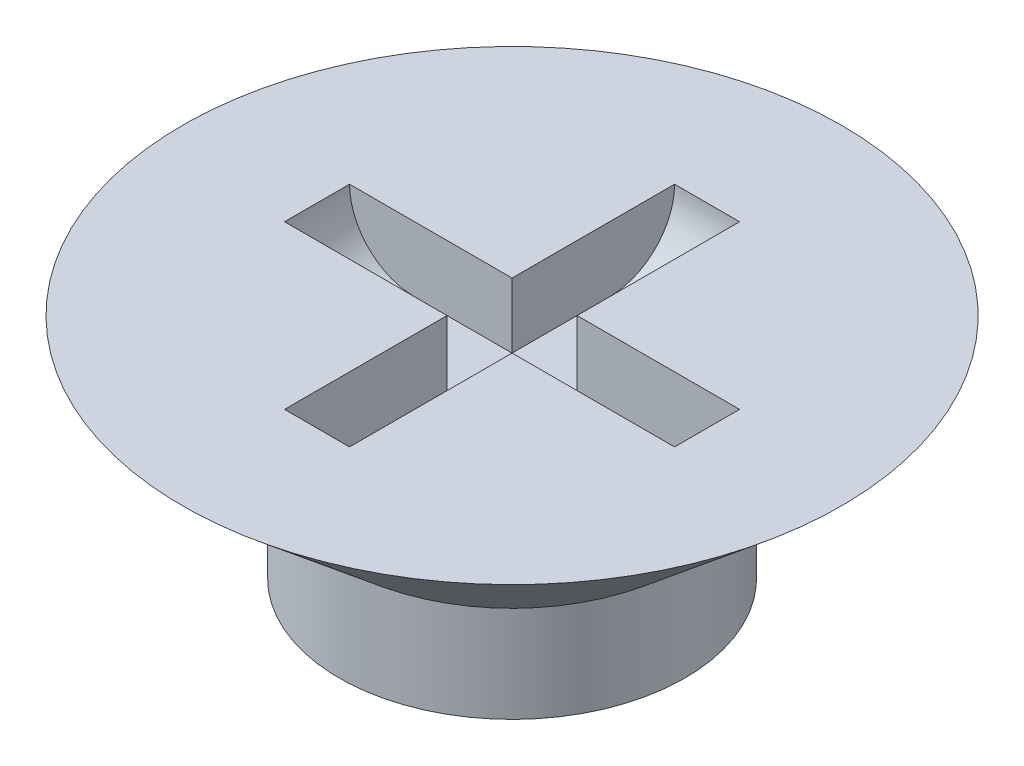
ISO-10303-21;
HEADER;
FILE_DESCRIPTION(('STEP AP214'),'2;1');
FILE_NAME('part.step','',(''),(''),'','','');
FILE_SCHEMA(('AUTOMOTIVE_DESIGN { 1 0 10303 214 1 1 1 1 }'));
ENDSEC;
DATA;
#1=APPLICATION_CONTEXT('core data for automotive mechanical design processes');
#2=APPLICATION_PROTOCOL_DEFINITION('international standard','automotive_design',2000,#1);
#3=PRODUCT_CONTEXT('',#1,'mechanical');
#4=PRODUCT('Part','Part','',(#3));
#5=PRODUCT_RELATED_PRODUCT_CATEGORY('part','',(#4));
#6=PRODUCT_DEFINITION_FORMATION('','',#4);
#7=PRODUCT_DEFINITION_CONTEXT('part definition',#1,'design');
#8=PRODUCT_DEFINITION('design','',#6,#7);
#9=PRODUCT_DEFINITION_SHAPE('','',#8);
#10=(LENGTH_UNIT() NAMED_UNIT(*) SI_UNIT(.MILLI.,.METRE.));
#11=(NAMED_UNIT(*) PLANE_ANGLE_UNIT() SI_UNIT($,.RADIAN.));
#12=(NAMED_UNIT(*) SI_UNIT($,.STERADIAN.) SOLID_ANGLE_UNIT());
#13=UNCERTAINTY_MEASURE_WITH_UNIT(LENGTH_MEASURE(1.E-05),#10,'distance_accuracy_value','');
#14=(GEOMETRIC_REPRESENTATION_CONTEXT(3) GLOBAL_UNCERTAINTY_ASSIGNED_CONTEXT((#13)) GLOBAL_UNIT_ASSIGNED_CONTEXT((#10,
#11,#12)) REPRESENTATION_CONTEXT('',''));
#15=CARTESIAN_POINT('',(0.,0.,0.));
#16=DIRECTION('',(0.,0.,1.));
#17=DIRECTION('',(1.,0.,0.));
#18=AXIS2_PLACEMENT_3D('',#15,#16,#17);
#19=CARTESIAN_POINT('',(0.,0.,-3.3782));
#20=DIRECTION('',(0.,-1.,0.));
#21=DIRECTION('',(0.,0.,-1.));
#22=AXIS2_PLACEMENT_3D('',#19,#20,#21);
#23=PLANE('',#22);
#24=CARTESIAN_POINT('',(0.,0.,0.));
#25=DIRECTION('',(0.,-1.,0.));
#26=DIRECTION('',(0.,0.,-1.));
#27=AXIS2_PLACEMENT_3D('',#24,#25,#26);
#28=CIRCLE('',#27,3.3782);
#29=CARTESIAN_POINT('',(0.,0.,-3.3782));
#30=VERTEX_POINT('',#29);
#31=EDGE_CURVE('E156',#30,#30,#28,.T.);
#32=ORIENTED_EDGE('',*,*,#31,.T.);
#33=EDGE_LOOP('',(#32));
#34=FACE_BOUND('',#33,.T.);
#35=ADVANCED_FACE('F33',(#34),#23,.T.);
#36=CARTESIAN_POINT('',(0.,4.445,0.));
#37=DIRECTION('',(0.,1.,0.));
#38=DIRECTION('',(0.,0.,1.));
#39=AXIS2_PLACEMENT_3D('',#36,#37,#38);
#40=PLANE('',#39);
#41=DIRECTION('',(1.,0.,0.));
#42=VECTOR('',#41,1.);
#43=CARTESIAN_POINT('',(0.,4.445,0.635));
#44=LINE('',#43,#42);
#45=CARTESIAN_POINT('',(-3.81,4.445,0.635));
#46=VERTEX_POINT('',#45);
#47=CARTESIAN_POINT('',(-0.635000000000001,4.445,0.635));
#48=VERTEX_POINT('',#47);
#49=EDGE_CURVE('E146',#46,#48,#44,.T.);
#50=ORIENTED_EDGE('',*,*,#49,.F.);
#51=DIRECTION('',(0.,0.,-1.));
#52=VECTOR('',#51,1.);
#53=CARTESIAN_POINT('',(-3.81,4.445,0.));
#54=LINE('',#53,#52);
#55=CARTESIAN_POINT('',(-3.81,4.445,-0.635));
#56=VERTEX_POINT('',#55);
#57=EDGE_CURVE('E142',#46,#56,#54,.T.);
#58=ORIENTED_EDGE('',*,*,#57,.T.);
#59=DIRECTION('',(1.,0.,0.));
#60=VECTOR('',#59,1.);
#61=CARTESIAN_POINT('',(0.,4.445,-0.635));
#62=LINE('',#61,#60);
#63=CARTESIAN_POINT('',(-0.635000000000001,4.445,-0.635));
#64=VERTEX_POINT('',#63);
#65=EDGE_CURVE('E221',#56,#64,#62,.T.);
#66=ORIENTED_EDGE('',*,*,#65,.T.);
#67=DIRECTION('',(0.,0.,-1.));
#68=VECTOR('',#67,1.);
#69=CARTESIAN_POINT('',(-0.635000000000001,4.445,0.));
#70=LINE('',#69,#68);
#71=CARTESIAN_POINT('',(-0.635000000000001,4.445,-3.81));
#72=VERTEX_POINT('',#71);
#73=EDGE_CURVE('E218',#64,#72,#70,.T.);
#74=ORIENTED_EDGE('',*,*,#73,.T.);
#75=DIRECTION('',(1.,0.,0.));
#76=VECTOR('',#75,1.);
#77=CARTESIAN_POINT('',(0.,4.445,-3.81));
#78=LINE('',#77,#76);
#79=CARTESIAN_POINT('',(0.634999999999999,4.445,-3.81));
#80=VERTEX_POINT('',#79);
#81=EDGE_CURVE('E215',#72,#80,#78,.T.);
#82=ORIENTED_EDGE('',*,*,#81,.T.);
#83=DIRECTION('',(0.,0.,-1.));
#84=VECTOR('',#83,1.);
#85=CARTESIAN_POINT('',(0.634999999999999,4.445,0.));
#86=LINE('',#85,#84);
#87=CARTESIAN_POINT('',(0.634999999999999,4.445,-0.635));
#88=VERTEX_POINT('',#87);
#89=EDGE_CURVE('E213',#88,#80,#86,.T.);
#90=ORIENTED_EDGE('',*,*,#89,.F.);
#91=DIRECTION('',(1.,0.,0.));
#92=VECTOR('',#91,1.);
#93=CARTESIAN_POINT('',(0.,4.445,-0.635));
#94=LINE('',#93,#92);
#95=CARTESIAN_POINT('',(3.81,4.445,-0.635));
#96=VERTEX_POINT('',#95);
#97=EDGE_CURVE('E210',#88,#96,#94,.T.);
#98=ORIENTED_EDGE('',*,*,#97,.T.);
#99=DIRECTION('',(0.,0.,-1.));
#100=VECTOR('',#99,1.);
#101=CARTESIAN_POINT('',(3.81,4.445,0.));
#102=LINE('',#101,#100);
#103=CARTESIAN_POINT('',(3.81,4.445,0.635000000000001));
#104=VERTEX_POINT('',#103);
#105=EDGE_CURVE('E207',#104,#96,#102,.T.);
#106=ORIENTED_EDGE('',*,*,#105,.F.);
#107=DIRECTION('',(1.,0.,0.));
#108=VECTOR('',#107,1.);
#109=CARTESIAN_POINT('',(0.,4.445,0.635));
#110=LINE('',#109,#108);
#111=CARTESIAN_POINT('',(0.634999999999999,4.445,0.635));
#112=VERTEX_POINT('',#111);
#113=EDGE_CURVE('E199',#112,#104,#110,.T.);
#114=ORIENTED_EDGE('',*,*,#113,.F.);
#115=DIRECTION('',(0.,0.,-1.));
#116=VECTOR('',#115,1.);
#117=CARTESIAN_POINT('',(0.634999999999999,4.445,0.));
#118=LINE('',#117,#116);
#119=CARTESIAN_POINT('',(0.634999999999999,4.445,3.81));
#120=VERTEX_POINT('',#119);
#121=EDGE_CURVE('E189',#120,#112,#118,.T.);
#122=ORIENTED_EDGE('',*,*,#121,.F.);
#123=DIRECTION('',(1.,0.,0.));
#124=VECTOR('',#123,1.);
#125=CARTESIAN_POINT('',(0.,4.445,3.81));
#126=LINE('',#125,#124);
#127=CARTESIAN_POINT('',(-0.635000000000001,4.445,3.81));
#128=VERTEX_POINT('',#127);
#129=EDGE_CURVE('E197',#128,#120,#126,.T.);
#130=ORIENTED_EDGE('',*,*,#129,.F.);
#131=DIRECTION('',(0.,0.,-1.));
#132=VECTOR('',#131,1.);
#133=CARTESIAN_POINT('',(-0.635000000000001,4.445,0.));
#134=LINE('',#133,#132);
#135=EDGE_CURVE('E201',#128,#48,#134,.T.);
#136=ORIENTED_EDGE('',*,*,#135,.T.);
#137=EDGE_LOOP('',(#50,#58,#66,#74,#82,#90,#98,#106,#114,#122,#130,#136));
#138=FACE_BOUND('',#137,.T.);
#139=CARTESIAN_POINT('',(0.,4.445,0.));
#140=DIRECTION('',(0.,-1.,0.));
#141=DIRECTION('',(0.,0.,-1.));
#142=AXIS2_PLACEMENT_3D('',#139,#140,#141);
#143=CIRCLE('',#142,6.4389);
#144=CARTESIAN_POINT('',(0.,4.445,-6.4389));
#145=VERTEX_POINT('',#144);
#146=EDGE_CURVE('E163',#145,#145,#143,.T.);
#147=ORIENTED_EDGE('',*,*,#146,.F.);
#148=EDGE_LOOP('',(#147));
#149=FACE_BOUND('',#148,.T.);
#150=ADVANCED_FACE('F195',(#138,#149),#40,.T.);
#151=CARTESIAN_POINT('',(0.,1.8796,0.));
#152=DIRECTION('',(0.,1.,0.));
#153=DIRECTION('',(0.,0.,1.));
#154=AXIS2_PLACEMENT_3D('',#151,#152,#153);
#155=CONICAL_SURFACE('',#154,3.3782,0.873207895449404);
#156=ORIENTED_EDGE('',*,*,#146,.T.);
#157=EDGE_LOOP('',(#156));
#158=FACE_BOUND('',#157,.T.);
#159=CARTESIAN_POINT('',(0.,1.8796,0.));
#160=DIRECTION('',(0.,-1.,0.));
#161=DIRECTION('',(0.,0.,-1.));
#162=AXIS2_PLACEMENT_3D('',#159,#160,#161);
#163=CIRCLE('',#162,3.3782);
#164=CARTESIAN_POINT('',(0.,1.8796,-3.3782));
#165=VERTEX_POINT('',#164);
#166=EDGE_CURVE('E159',#165,#165,#163,.T.);
#167=ORIENTED_EDGE('',*,*,#166,.F.);
#168=EDGE_LOOP('',(#167));
#169=FACE_BOUND('',#168,.T.);
#170=ADVANCED_FACE('F270',(#158,#169),#155,.T.);
#171=CARTESIAN_POINT('',(0.,0.,0.));
#172=DIRECTION('',(0.,-1.,0.));
#173=DIRECTION('',(0.,0.,-1.));
#174=AXIS2_PLACEMENT_3D('',#171,#172,#173);
#175=CYLINDRICAL_SURFACE('',#174,3.3782);
#176=ORIENTED_EDGE('',*,*,#166,.T.);
#177=EDGE_LOOP('',(#176));
#178=FACE_BOUND('',#177,.T.);
#179=ORIENTED_EDGE('',*,*,#31,.F.);
#180=EDGE_LOOP('',(#179));
#181=FACE_BOUND('',#180,.T.);
#182=ADVANCED_FACE('F291',(#178,#181),#175,.T.);
#183=CARTESIAN_POINT('',(0.,3.175,0.635));
#184=DIRECTION('',(0.,0.,1.));
#185=DIRECTION('',(1.,0.,0.));
#186=AXIS2_PLACEMENT_3D('',#183,#184,#185);
#187=PLANE('',#186);
#188=DIRECTION('',(1.,0.,0.));
#189=VECTOR('',#188,1.);
#190=CARTESIAN_POINT('',(0.,3.175,0.635));
#191=LINE('',#190,#189);
#192=CARTESIAN_POINT('',(-2.54,3.175,0.635));
#193=VERTEX_POINT('',#192);
#194=CARTESIAN_POINT('',(-0.635000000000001,3.175,0.635));
#195=VERTEX_POINT('',#194);
#196=EDGE_CURVE('E133',#193,#195,#191,.T.);
#197=ORIENTED_EDGE('',*,*,#196,.F.);
#198=CARTESIAN_POINT('',(-2.54,4.445,0.635));
#199=DIRECTION('',(0.,0.,1.));
#200=DIRECTION('',(1.,0.,0.));
#201=AXIS2_PLACEMENT_3D('',#198,#199,#200);
#202=CIRCLE('',#201,1.27);
#203=EDGE_CURVE('E175',#193,#46,#202,.F.);
#204=ORIENTED_EDGE('',*,*,#203,.T.);
#205=ORIENTED_EDGE('',*,*,#49,.T.);
#206=DIRECTION('',(0.,1.,0.));
#207=VECTOR('',#206,1.);
#208=CARTESIAN_POINT('',(-0.635000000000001,3.175,0.635));
#209=LINE('',#208,#207);
#210=EDGE_CURVE('E127',#195,#48,#209,.T.);
#211=ORIENTED_EDGE('',*,*,#210,.F.);
#212=EDGE_LOOP('',(#197,#204,#205,#211));
#213=FACE_BOUND('',#212,.T.);
#214=ADVANCED_FACE('F144',(#213),#187,.F.);
#215=CARTESIAN_POINT('',(0.,3.175,-0.635));
#216=DIRECTION('',(0.,0.,1.));
#217=DIRECTION('',(1.,0.,0.));
#218=AXIS2_PLACEMENT_3D('',#215,#216,#217);
#219=PLANE('',#218);
#220=ORIENTED_EDGE('',*,*,#65,.F.);
#221=CARTESIAN_POINT('',(-2.54,4.445,-0.635));
#222=DIRECTION('',(0.,0.,1.));
#223=DIRECTION('',(1.,0.,0.));
#224=AXIS2_PLACEMENT_3D('',#221,#222,#223);
#225=CIRCLE('',#224,1.27);
#226=CARTESIAN_POINT('',(-2.54,3.175,-0.635));
#227=VERTEX_POINT('',#226);
#228=EDGE_CURVE('E166',#56,#227,#225,.T.);
#229=ORIENTED_EDGE('',*,*,#228,.T.);
#230=DIRECTION('',(1.,0.,0.));
#231=VECTOR('',#230,1.);
#232=CARTESIAN_POINT('',(0.,3.175,-0.635));
#233=LINE('',#232,#231);
#234=CARTESIAN_POINT('',(-0.635000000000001,3.175,-0.635));
#235=VERTEX_POINT('',#234);
#236=EDGE_CURVE('E148',#227,#235,#233,.T.);
#237=ORIENTED_EDGE('',*,*,#236,.T.);
#238=DIRECTION('',(0.,1.,0.));
#239=VECTOR('',#238,1.);
#240=CARTESIAN_POINT('',(-0.635000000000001,3.175,-0.635));
#241=LINE('',#240,#239);
#242=EDGE_CURVE('E160',#235,#64,#241,.T.);
#243=ORIENTED_EDGE('',*,*,#242,.T.);
#244=EDGE_LOOP('',(#220,#229,#237,#243));
#245=FACE_BOUND('',#244,.T.);
#246=ADVANCED_FACE('F283',(#245),#219,.T.);
#247=CARTESIAN_POINT('',(-0.635000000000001,3.175,0.));
#248=DIRECTION('',(1.,0.,0.));
#249=DIRECTION('',(0.,0.,-1.));
#250=AXIS2_PLACEMENT_3D('',#247,#248,#249);
#251=PLANE('',#250);
#252=DIRECTION('',(0.,0.,-1.));
#253=VECTOR('',#252,1.);
#254=CARTESIAN_POINT('',(-0.635000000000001,3.175,0.));
#255=LINE('',#254,#253);
#256=CARTESIAN_POINT('',(-0.635000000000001,3.175,-2.54));
#257=VERTEX_POINT('',#256);
#258=EDGE_CURVE('E152',#235,#257,#255,.T.);
#259=ORIENTED_EDGE('',*,*,#258,.T.);
#260=CARTESIAN_POINT('',(-0.635000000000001,4.445,-2.54));
#261=DIRECTION('',(1.,0.,0.));
#262=DIRECTION('',(0.,0.,-1.));
#263=AXIS2_PLACEMENT_3D('',#260,#261,#262);
#264=CIRCLE('',#263,1.27);
#265=EDGE_CURVE('E178',#257,#72,#264,.T.);
#266=ORIENTED_EDGE('',*,*,#265,.T.);
#267=ORIENTED_EDGE('',*,*,#73,.F.);
#268=ORIENTED_EDGE('',*,*,#242,.F.);
#269=EDGE_LOOP('',(#259,#266,#267,#268));
#270=FACE_BOUND('',#269,.T.);
#271=ADVANCED_FACE('F240',(#270),#251,.T.);
#272=CARTESIAN_POINT('',(0.634999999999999,3.175,0.));
#273=DIRECTION('',(1.,0.,0.));
#274=DIRECTION('',(0.,0.,-1.));
#275=AXIS2_PLACEMENT_3D('',#272,#273,#274);
#276=PLANE('',#275);
#277=ORIENTED_EDGE('',*,*,#89,.T.);
#278=CARTESIAN_POINT('',(0.634999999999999,4.445,-2.54));
#279=DIRECTION('',(1.,0.,0.));
#280=DIRECTION('',(0.,0.,-1.));
#281=AXIS2_PLACEMENT_3D('',#278,#279,#280);
#282=CIRCLE('',#281,1.27);
#283=CARTESIAN_POINT('',(0.634999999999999,3.175,-2.54));
#284=VERTEX_POINT('',#283);
#285=EDGE_CURVE('E56',#80,#284,#282,.F.);
#286=ORIENTED_EDGE('',*,*,#285,.T.);
#287=DIRECTION('',(0.,0.,-1.));
#288=VECTOR('',#287,1.);
#289=CARTESIAN_POINT('',(0.634999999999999,3.175,0.));
#290=LINE('',#289,#288);
#291=CARTESIAN_POINT('',(0.634999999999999,3.175,-0.635));
#292=VERTEX_POINT('',#291);
#293=EDGE_CURVE('E229',#292,#284,#290,.T.);
#294=ORIENTED_EDGE('',*,*,#293,.F.);
#295=DIRECTION('',(0.,1.,0.));
#296=VECTOR('',#295,1.);
#297=CARTESIAN_POINT('',(0.634999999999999,3.175,-0.635));
#298=LINE('',#297,#296);
#299=EDGE_CURVE('E150',#292,#88,#298,.T.);
#300=ORIENTED_EDGE('',*,*,#299,.T.);
#301=EDGE_LOOP('',(#277,#286,#294,#300));
#302=FACE_BOUND('',#301,.T.);
#303=ADVANCED_FACE('F227',(#302),#276,.F.);
#304=CARTESIAN_POINT('',(0.,3.175,-0.635));
#305=DIRECTION('',(0.,0.,1.));
#306=DIRECTION('',(1.,0.,0.));
#307=AXIS2_PLACEMENT_3D('',#304,#305,#306);
#308=PLANE('',#307);
#309=DIRECTION('',(1.,0.,0.));
#310=VECTOR('',#309,1.);
#311=CARTESIAN_POINT('',(0.,3.175,-0.635));
#312=LINE('',#311,#310);
#313=CARTESIAN_POINT('',(2.54,3.175,-0.635));
#314=VERTEX_POINT('',#313);
#315=EDGE_CURVE('E243',#292,#314,#312,.T.);
#316=ORIENTED_EDGE('',*,*,#315,.T.);
#317=CARTESIAN_POINT('',(2.54,4.445,-0.635));
#318=DIRECTION('',(0.,0.,1.));
#319=DIRECTION('',(1.,0.,0.));
#320=AXIS2_PLACEMENT_3D('',#317,#318,#319);
#321=CIRCLE('',#320,1.27);
#322=EDGE_CURVE('E180',#314,#96,#321,.T.);
#323=ORIENTED_EDGE('',*,*,#322,.T.);
#324=ORIENTED_EDGE('',*,*,#97,.F.);
#325=ORIENTED_EDGE('',*,*,#299,.F.);
#326=EDGE_LOOP('',(#316,#323,#324,#325));
#327=FACE_BOUND('',#326,.T.);
#328=ADVANCED_FACE('F233',(#327),#308,.T.);
#329=CARTESIAN_POINT('',(0.,3.175,0.635));
#330=DIRECTION('',(0.,0.,1.));
#331=DIRECTION('',(1.,0.,0.));
#332=AXIS2_PLACEMENT_3D('',#329,#330,#331);
#333=PLANE('',#332);
#334=ORIENTED_EDGE('',*,*,#113,.T.);
#335=CARTESIAN_POINT('',(2.54,4.445,0.635000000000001));
#336=DIRECTION('',(0.,0.,1.));
#337=DIRECTION('',(1.,0.,0.));
#338=AXIS2_PLACEMENT_3D('',#335,#336,#337);
#339=CIRCLE('',#338,1.27);
#340=CARTESIAN_POINT('',(2.54,3.175,0.635000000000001));
#341=VERTEX_POINT('',#340);
#342=EDGE_CURVE('E182',#104,#341,#339,.F.);
#343=ORIENTED_EDGE('',*,*,#342,.T.);
#344=DIRECTION('',(1.,0.,0.));
#345=VECTOR('',#344,1.);
#346=CARTESIAN_POINT('',(0.,3.175,0.635));
#347=LINE('',#346,#345);
#348=CARTESIAN_POINT('',(0.634999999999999,3.175,0.635));
#349=VERTEX_POINT('',#348);
#350=EDGE_CURVE('E247',#349,#341,#347,.T.);
#351=ORIENTED_EDGE('',*,*,#350,.F.);
#352=DIRECTION('',(0.,1.,0.));
#353=VECTOR('',#352,1.);
#354=CARTESIAN_POINT('',(0.634999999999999,3.175,0.635));
#355=LINE('',#354,#353);
#356=EDGE_CURVE('E147',#349,#112,#355,.T.);
#357=ORIENTED_EDGE('',*,*,#356,.T.);
#358=EDGE_LOOP('',(#334,#343,#351,#357));
#359=FACE_BOUND('',#358,.T.);
#360=ADVANCED_FACE('F253',(#359),#333,.F.);
#361=CARTESIAN_POINT('',(0.634999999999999,3.175,0.));
#362=DIRECTION('',(1.,0.,0.));
#363=DIRECTION('',(0.,0.,-1.));
#364=AXIS2_PLACEMENT_3D('',#361,#362,#363);
#365=PLANE('',#364);
#366=DIRECTION('',(0.,0.,-1.));
#367=VECTOR('',#366,1.);
#368=CARTESIAN_POINT('',(0.634999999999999,3.175,0.));
#369=LINE('',#368,#367);
#370=CARTESIAN_POINT('',(0.634999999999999,3.175,2.54));
#371=VERTEX_POINT('',#370);
#372=EDGE_CURVE('E132',#371,#349,#369,.T.);
#373=ORIENTED_EDGE('',*,*,#372,.F.);
#374=CARTESIAN_POINT('',(0.634999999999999,4.445,2.54));
#375=DIRECTION('',(1.,0.,0.));
#376=DIRECTION('',(0.,0.,-1.));
#377=AXIS2_PLACEMENT_3D('',#374,#375,#376);
#378=CIRCLE('',#377,1.27);
#379=EDGE_CURVE('E41',#371,#120,#378,.F.);
#380=ORIENTED_EDGE('',*,*,#379,.T.);
#381=ORIENTED_EDGE('',*,*,#121,.T.);
#382=ORIENTED_EDGE('',*,*,#356,.F.);
#383=EDGE_LOOP('',(#373,#380,#381,#382));
#384=FACE_BOUND('',#383,.T.);
#385=ADVANCED_FACE('F187',(#384),#365,.F.);
#386=CARTESIAN_POINT('',(-0.635000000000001,3.175,0.));
#387=DIRECTION('',(1.,0.,0.));
#388=DIRECTION('',(0.,0.,-1.));
#389=AXIS2_PLACEMENT_3D('',#386,#387,#388);
#390=PLANE('',#389);
#391=ORIENTED_EDGE('',*,*,#135,.F.);
#392=CARTESIAN_POINT('',(-0.635000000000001,4.445,2.54));
#393=DIRECTION('',(1.,0.,0.));
#394=DIRECTION('',(0.,0.,-1.));
#395=AXIS2_PLACEMENT_3D('',#392,#393,#394);
#396=CIRCLE('',#395,1.27);
#397=CARTESIAN_POINT('',(-0.635000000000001,3.175,2.54));
#398=VERTEX_POINT('',#397);
#399=EDGE_CURVE('E11',#128,#398,#396,.T.);
#400=ORIENTED_EDGE('',*,*,#399,.T.);
#401=DIRECTION('',(0.,0.,-1.));
#402=VECTOR('',#401,1.);
#403=CARTESIAN_POINT('',(-0.635000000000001,3.175,0.));
#404=LINE('',#403,#402);
#405=EDGE_CURVE('E123',#398,#195,#404,.T.);
#406=ORIENTED_EDGE('',*,*,#405,.T.);
#407=ORIENTED_EDGE('',*,*,#210,.T.);
#408=EDGE_LOOP('',(#391,#400,#406,#407));
#409=FACE_BOUND('',#408,.T.);
#410=ADVANCED_FACE('F125',(#409),#390,.T.);
#411=CARTESIAN_POINT('',(0.,3.175,0.));
#412=DIRECTION('',(0.,1.,0.));
#413=DIRECTION('',(0.,0.,1.));
#414=AXIS2_PLACEMENT_3D('',#411,#412,#413);
#415=PLANE('',#414);
#416=ORIENTED_EDGE('',*,*,#236,.F.);
#417=DIRECTION('',(0.,0.,-1.));
#418=VECTOR('',#417,1.);
#419=CARTESIAN_POINT('',(-2.54,3.175,0.635));
#420=LINE('',#419,#418);
#421=EDGE_CURVE('E139',#227,#193,#420,.F.);
#422=ORIENTED_EDGE('',*,*,#421,.T.);
#423=ORIENTED_EDGE('',*,*,#196,.T.);
#424=ORIENTED_EDGE('',*,*,#405,.F.);
#425=DIRECTION('',(1.,0.,0.));
#426=VECTOR('',#425,1.);
#427=CARTESIAN_POINT('',(0.,3.175,2.54));
#428=LINE('',#427,#426);
#429=EDGE_CURVE('E168',#398,#371,#428,.T.);
#430=ORIENTED_EDGE('',*,*,#429,.T.);
#431=ORIENTED_EDGE('',*,*,#372,.T.);
#432=ORIENTED_EDGE('',*,*,#350,.T.);
#433=DIRECTION('',(0.,0.,-1.));
#434=VECTOR('',#433,1.);
#435=CARTESIAN_POINT('',(2.54,3.175,0.));
#436=LINE('',#435,#434);
#437=EDGE_CURVE('E170',#341,#314,#436,.T.);
#438=ORIENTED_EDGE('',*,*,#437,.T.);
#439=ORIENTED_EDGE('',*,*,#315,.F.);
#440=ORIENTED_EDGE('',*,*,#293,.T.);
#441=DIRECTION('',(1.,0.,0.));
#442=VECTOR('',#441,1.);
#443=CARTESIAN_POINT('',(-0.635,3.175,-2.54));
#444=LINE('',#443,#442);
#445=EDGE_CURVE('E48',#284,#257,#444,.F.);
#446=ORIENTED_EDGE('',*,*,#445,.T.);
#447=ORIENTED_EDGE('',*,*,#258,.F.);
#448=EDGE_LOOP('',(#416,#422,#423,#424,#430,#431,#432,#438,#439,#440,#446,#447));
#449=FACE_BOUND('',#448,.T.);
#450=ADVANCED_FACE('F137',(#449),#415,.T.);
#451=CARTESIAN_POINT('',(-2.54,4.445,0.));
#452=DIRECTION('',(0.,0.,1.));
#453=DIRECTION('',(1.,0.,0.));
#454=AXIS2_PLACEMENT_3D('',#451,#452,#453);
#455=CYLINDRICAL_SURFACE('',#454,1.27);
#456=ORIENTED_EDGE('',*,*,#203,.F.);
#457=ORIENTED_EDGE('',*,*,#421,.F.);
#458=ORIENTED_EDGE('',*,*,#228,.F.);
#459=ORIENTED_EDGE('',*,*,#57,.F.);
#460=EDGE_LOOP('',(#456,#457,#458,#459));
#461=FACE_BOUND('',#460,.T.);
#462=ADVANCED_FACE('F262',(#461),#455,.F.);
#463=CARTESIAN_POINT('',(0.,4.445,-2.54));
#464=DIRECTION('',(-1.,0.,0.));
#465=DIRECTION('',(0.,0.,1.));
#466=AXIS2_PLACEMENT_3D('',#463,#464,#465);
#467=CYLINDRICAL_SURFACE('',#466,1.27);
#468=ORIENTED_EDGE('',*,*,#265,.F.);
#469=ORIENTED_EDGE('',*,*,#445,.F.);
#470=ORIENTED_EDGE('',*,*,#285,.F.);
#471=ORIENTED_EDGE('',*,*,#81,.F.);
#472=EDGE_LOOP('',(#468,#469,#470,#471));
#473=FACE_BOUND('',#472,.T.);
#474=ADVANCED_FACE('F238',(#473),#467,.F.);
#475=CARTESIAN_POINT('',(2.54,4.445,0.));
#476=DIRECTION('',(0.,0.,-1.));
#477=DIRECTION('',(-1.,0.,0.));
#478=AXIS2_PLACEMENT_3D('',#475,#476,#477);
#479=CYLINDRICAL_SURFACE('',#478,1.27);
#480=ORIENTED_EDGE('',*,*,#342,.F.);
#481=ORIENTED_EDGE('',*,*,#105,.T.);
#482=ORIENTED_EDGE('',*,*,#322,.F.);
#483=ORIENTED_EDGE('',*,*,#437,.F.);
#484=EDGE_LOOP('',(#480,#481,#482,#483));
#485=FACE_BOUND('',#484,.T.);
#486=ADVANCED_FACE('F256',(#485),#479,.F.);
#487=CARTESIAN_POINT('',(0.,4.445,2.54));
#488=DIRECTION('',(1.,0.,0.));
#489=DIRECTION('',(0.,0.,-1.));
#490=AXIS2_PLACEMENT_3D('',#487,#488,#489);
#491=CYLINDRICAL_SURFACE('',#490,1.27);
#492=ORIENTED_EDGE('',*,*,#399,.F.);
#493=ORIENTED_EDGE('',*,*,#129,.T.);
#494=ORIENTED_EDGE('',*,*,#379,.F.);
#495=ORIENTED_EDGE('',*,*,#429,.F.);
#496=EDGE_LOOP('',(#492,#493,#494,#495));
#497=FACE_BOUND('',#496,.T.);
#498=ADVANCED_FACE('F35',(#497),#491,.F.);
#499=CLOSED_SHELL('',(#35,#150,#170,#182,#214,#246,#271,#303,#328,#360,#385,#410,#450,#462,#474,
#486,#498));
#500=MANIFOLD_SOLID_BREP('B2',#499);
#501=ADVANCED_BREP_SHAPE_REPRESENTATION('',(#18,#500),#14);
#502=SHAPE_DEFINITION_REPRESENTATION(#9,#501);
ENDSEC;
END-ISO-10303-21;
